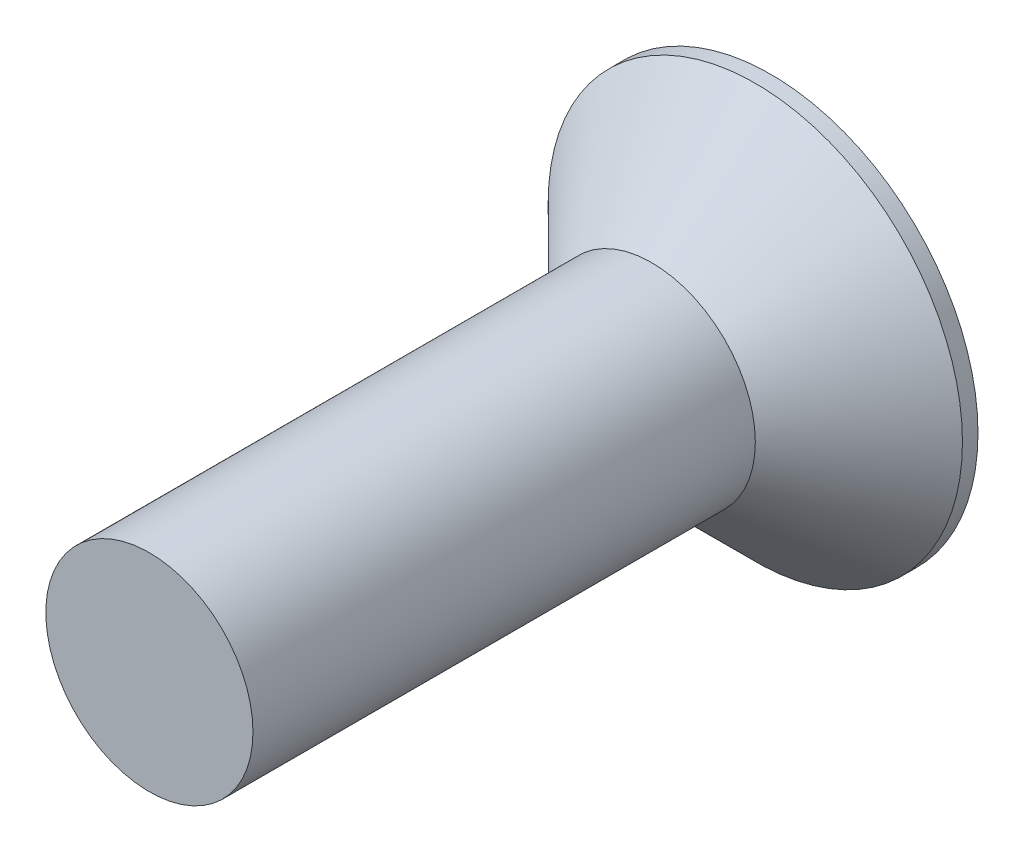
ISO-10303-21;
HEADER;
FILE_DESCRIPTION(('STEP AP214'),'2;1');
FILE_NAME('part.step','',(''),(''),'','','');
FILE_SCHEMA(('AUTOMOTIVE_DESIGN { 1 0 10303 214 1 1 1 1 }'));
ENDSEC;
DATA;
#1=APPLICATION_CONTEXT('core data for automotive mechanical design processes');
#2=APPLICATION_PROTOCOL_DEFINITION('international standard','automotive_design',2000,#1);
#3=PRODUCT_CONTEXT('',#1,'mechanical');
#4=PRODUCT('Part','Part','',(#3));
#5=PRODUCT_RELATED_PRODUCT_CATEGORY('part','',(#4));
#6=PRODUCT_DEFINITION_FORMATION('','',#4);
#7=PRODUCT_DEFINITION_CONTEXT('part definition',#1,'design');
#8=PRODUCT_DEFINITION('design','',#6,#7);
#9=PRODUCT_DEFINITION_SHAPE('','',#8);
#10=(LENGTH_UNIT() NAMED_UNIT(*) SI_UNIT(.MILLI.,.METRE.));
#11=(NAMED_UNIT(*) PLANE_ANGLE_UNIT() SI_UNIT($,.RADIAN.));
#12=(NAMED_UNIT(*) SI_UNIT($,.STERADIAN.) SOLID_ANGLE_UNIT());
#13=UNCERTAINTY_MEASURE_WITH_UNIT(LENGTH_MEASURE(1.E-05),#10,'distance_accuracy_value','');
#14=(GEOMETRIC_REPRESENTATION_CONTEXT(3) GLOBAL_UNCERTAINTY_ASSIGNED_CONTEXT((#13)) GLOBAL_UNIT_ASSIGNED_CONTEXT((#10,
#11,#12)) REPRESENTATION_CONTEXT('',''));
#15=CARTESIAN_POINT('',(0.,0.,0.));
#16=DIRECTION('',(0.,0.,1.));
#17=DIRECTION('',(1.,0.,0.));
#18=AXIS2_PLACEMENT_3D('',#15,#16,#17);
#19=CARTESIAN_POINT('',(0.,0.,12.));
#20=DIRECTION('',(0.,0.,1.));
#21=DIRECTION('',(1.,0.,0.));
#22=AXIS2_PLACEMENT_3D('',#19,#20,#21);
#23=PLANE('',#22);
#24=CARTESIAN_POINT('',(0.,0.,12.));
#25=DIRECTION('',(0.,0.,1.));
#26=DIRECTION('',(1.,0.,0.));
#27=AXIS2_PLACEMENT_3D('',#24,#25,#26);
#28=CIRCLE('',#27,2.);
#29=CARTESIAN_POINT('',(2.,0.,12.));
#30=VERTEX_POINT('',#29);
#31=EDGE_CURVE('E11',#30,#30,#28,.T.);
#32=ORIENTED_EDGE('',*,*,#31,.T.);
#33=EDGE_LOOP('',(#32));
#34=FACE_BOUND('',#33,.T.);
#35=ADVANCED_FACE('F32',(#34),#23,.T.);
#36=CARTESIAN_POINT('',(0.,0.,12.));
#37=DIRECTION('',(0.,0.,1.));
#38=DIRECTION('',(1.,0.,0.));
#39=AXIS2_PLACEMENT_3D('',#36,#37,#38);
#40=CYLINDRICAL_SURFACE('',#39,2.);
#41=CARTESIAN_POINT('',(0.,0.,2.3));
#42=DIRECTION('',(0.,0.,1.));
#43=DIRECTION('',(1.,0.,0.));
#44=AXIS2_PLACEMENT_3D('',#41,#42,#43);
#45=CIRCLE('',#44,2.);
#46=CARTESIAN_POINT('',(2.,0.,2.3));
#47=VERTEX_POINT('',#46);
#48=EDGE_CURVE('E39',#47,#47,#45,.T.);
#49=ORIENTED_EDGE('',*,*,#48,.T.);
#50=EDGE_LOOP('',(#49));
#51=FACE_BOUND('',#50,.T.);
#52=ORIENTED_EDGE('',*,*,#31,.F.);
#53=EDGE_LOOP('',(#52));
#54=FACE_BOUND('',#53,.T.);
#55=ADVANCED_FACE('F146',(#51,#54),#40,.T.);
#56=CARTESIAN_POINT('',(0.,0.,2.3));
#57=DIRECTION('',(0.,0.,-1.));
#58=DIRECTION('',(-1.,0.,0.));
#59=AXIS2_PLACEMENT_3D('',#56,#57,#58);
#60=CONICAL_SURFACE('',#59,2.,0.78539816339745);
#61=CARTESIAN_POINT('',(0.,0.,0.300000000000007));
#62=DIRECTION('',(0.,0.,1.));
#63=DIRECTION('',(1.,0.,0.));
#64=AXIS2_PLACEMENT_3D('',#61,#62,#63);
#65=CIRCLE('',#64,4.);
#66=CARTESIAN_POINT('',(4.,0.,0.300000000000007));
#67=VERTEX_POINT('',#66);
#68=EDGE_CURVE('E141',#67,#67,#65,.T.);
#69=ORIENTED_EDGE('',*,*,#68,.T.);
#70=EDGE_LOOP('',(#69));
#71=FACE_BOUND('',#70,.T.);
#72=ORIENTED_EDGE('',*,*,#48,.F.);
#73=EDGE_LOOP('',(#72));
#74=FACE_BOUND('',#73,.T.);
#75=ADVANCED_FACE('F149',(#71,#74),#60,.T.);
#76=CARTESIAN_POINT('',(0.,0.,12.));
#77=DIRECTION('',(0.,0.,1.));
#78=DIRECTION('',(1.,0.,0.));
#79=AXIS2_PLACEMENT_3D('',#76,#77,#78);
#80=CYLINDRICAL_SURFACE('',#79,4.);
#81=CARTESIAN_POINT('',(0.,0.,0.));
#82=DIRECTION('',(0.,0.,1.));
#83=DIRECTION('',(1.,0.,0.));
#84=AXIS2_PLACEMENT_3D('',#81,#82,#83);
#85=CIRCLE('',#84,4.);
#86=CARTESIAN_POINT('',(4.,0.,0.));
#87=VERTEX_POINT('',#86);
#88=EDGE_CURVE('E133',#87,#87,#85,.T.);
#89=ORIENTED_EDGE('',*,*,#88,.T.);
#90=EDGE_LOOP('',(#89));
#91=FACE_BOUND('',#90,.T.);
#92=ORIENTED_EDGE('',*,*,#68,.F.);
#93=EDGE_LOOP('',(#92));
#94=FACE_BOUND('',#93,.T.);
#95=ADVANCED_FACE('F151',(#91,#94),#80,.T.);
#96=CARTESIAN_POINT('',(0.,-4.,0.));
#97=DIRECTION('',(0.,0.,-1.));
#98=DIRECTION('',(-1.,0.,0.));
#99=AXIS2_PLACEMENT_3D('',#96,#97,#98);
#100=PLANE('',#99);
#101=DIRECTION('',(0.866025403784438,-0.5,0.));
#102=VECTOR('',#101,1.);
#103=CARTESIAN_POINT('',(0.,1.44337567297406,0.));
#104=LINE('',#103,#102);
#105=CARTESIAN_POINT('',(0.,1.44337567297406,0.));
#106=VERTEX_POINT('',#105);
#107=CARTESIAN_POINT('',(1.25,0.721687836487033,0.));
#108=VERTEX_POINT('',#107);
#109=EDGE_CURVE('E46',#106,#108,#104,.T.);
#110=ORIENTED_EDGE('',*,*,#109,.F.);
#111=DIRECTION('',(0.866025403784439,0.5,0.));
#112=VECTOR('',#111,1.);
#113=CARTESIAN_POINT('',(-1.25,0.721687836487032,0.));
#114=LINE('',#113,#112);
#115=CARTESIAN_POINT('',(-1.25,0.721687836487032,0.));
#116=VERTEX_POINT('',#115);
#117=EDGE_CURVE('E129',#116,#106,#114,.T.);
#118=ORIENTED_EDGE('',*,*,#117,.F.);
#119=DIRECTION('',(0.,1.,0.));
#120=VECTOR('',#119,1.);
#121=CARTESIAN_POINT('',(-1.25,-0.721687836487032,0.));
#122=LINE('',#121,#120);
#123=CARTESIAN_POINT('',(-1.25,-0.721687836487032,0.));
#124=VERTEX_POINT('',#123);
#125=EDGE_CURVE('E127',#124,#116,#122,.T.);
#126=ORIENTED_EDGE('',*,*,#125,.F.);
#127=DIRECTION('',(-0.866025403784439,0.5,0.));
#128=VECTOR('',#127,1.);
#129=CARTESIAN_POINT('',(0.,-1.44337567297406,0.));
#130=LINE('',#129,#128);
#131=CARTESIAN_POINT('',(0.,-1.44337567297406,0.));
#132=VERTEX_POINT('',#131);
#133=EDGE_CURVE('E94',#132,#124,#130,.T.);
#134=ORIENTED_EDGE('',*,*,#133,.F.);
#135=DIRECTION('',(-0.866025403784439,-0.5,0.));
#136=VECTOR('',#135,1.);
#137=CARTESIAN_POINT('',(1.25,-0.721687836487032,0.));
#138=LINE('',#137,#136);
#139=CARTESIAN_POINT('',(1.25,-0.721687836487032,0.));
#140=VERTEX_POINT('',#139);
#141=EDGE_CURVE('E123',#140,#132,#138,.T.);
#142=ORIENTED_EDGE('',*,*,#141,.F.);
#143=DIRECTION('',(0.,-1.,0.));
#144=VECTOR('',#143,1.);
#145=CARTESIAN_POINT('',(1.25,0.721687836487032,0.));
#146=LINE('',#145,#144);
#147=EDGE_CURVE('E120',#108,#140,#146,.T.);
#148=ORIENTED_EDGE('',*,*,#147,.F.);
#149=EDGE_LOOP('',(#110,#118,#126,#134,#142,#148));
#150=FACE_BOUND('',#149,.T.);
#151=ORIENTED_EDGE('',*,*,#88,.F.);
#152=EDGE_LOOP('',(#151));
#153=FACE_BOUND('',#152,.T.);
#154=ADVANCED_FACE('F158',(#150,#153),#100,.T.);
#155=CARTESIAN_POINT('',(0.,1.44337567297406,2.));
#156=DIRECTION('',(0.5,0.866025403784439,0.));
#157=DIRECTION('',(-0.866025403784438,0.5,0.));
#158=AXIS2_PLACEMENT_3D('',#155,#156,#157);
#159=PLANE('',#158);
#160=ORIENTED_EDGE('',*,*,#109,.T.);
#161=DIRECTION('',(0.,0.,-1.));
#162=VECTOR('',#161,1.);
#163=CARTESIAN_POINT('',(1.25,0.721687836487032,2.));
#164=LINE('',#163,#162);
#165=CARTESIAN_POINT('',(1.25,0.721687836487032,2.));
#166=VERTEX_POINT('',#165);
#167=EDGE_CURVE('E76',#166,#108,#164,.T.);
#168=ORIENTED_EDGE('',*,*,#167,.F.);
#169=DIRECTION('',(0.866025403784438,-0.5,0.));
#170=VECTOR('',#169,1.);
#171=CARTESIAN_POINT('',(0.,1.44337567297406,2.));
#172=LINE('',#171,#170);
#173=CARTESIAN_POINT('',(0.,1.44337567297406,2.));
#174=VERTEX_POINT('',#173);
#175=EDGE_CURVE('E131',#174,#166,#172,.T.);
#176=ORIENTED_EDGE('',*,*,#175,.F.);
#177=DIRECTION('',(0.,0.,-1.));
#178=VECTOR('',#177,1.);
#179=CARTESIAN_POINT('',(0.,1.44337567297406,2.));
#180=LINE('',#179,#178);
#181=EDGE_CURVE('E54',#174,#106,#180,.T.);
#182=ORIENTED_EDGE('',*,*,#181,.T.);
#183=EDGE_LOOP('',(#160,#168,#176,#182));
#184=FACE_BOUND('',#183,.T.);
#185=ADVANCED_FACE('F189',(#184),#159,.F.);
#186=CARTESIAN_POINT('',(-1.25,0.721687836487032,2.));
#187=DIRECTION('',(-0.5,0.866025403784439,0.));
#188=DIRECTION('',(-0.866025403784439,-0.5,0.));
#189=AXIS2_PLACEMENT_3D('',#186,#187,#188);
#190=PLANE('',#189);
#191=ORIENTED_EDGE('',*,*,#117,.T.);
#192=ORIENTED_EDGE('',*,*,#181,.F.);
#193=DIRECTION('',(0.866025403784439,0.5,0.));
#194=VECTOR('',#193,1.);
#195=CARTESIAN_POINT('',(-1.25,0.721687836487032,2.));
#196=LINE('',#195,#194);
#197=CARTESIAN_POINT('',(-1.25,0.721687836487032,2.));
#198=VERTEX_POINT('',#197);
#199=EDGE_CURVE('E106',#198,#174,#196,.T.);
#200=ORIENTED_EDGE('',*,*,#199,.F.);
#201=DIRECTION('',(0.,0.,-1.));
#202=VECTOR('',#201,1.);
#203=CARTESIAN_POINT('',(-1.25,0.721687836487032,2.));
#204=LINE('',#203,#202);
#205=EDGE_CURVE('E98',#198,#116,#204,.T.);
#206=ORIENTED_EDGE('',*,*,#205,.T.);
#207=EDGE_LOOP('',(#191,#192,#200,#206));
#208=FACE_BOUND('',#207,.T.);
#209=ADVANCED_FACE('F199',(#208),#190,.F.);
#210=CARTESIAN_POINT('',(-1.25,-0.721687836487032,2.));
#211=DIRECTION('',(-1.,0.,0.));
#212=DIRECTION('',(0.,-1.,0.));
#213=AXIS2_PLACEMENT_3D('',#210,#211,#212);
#214=PLANE('',#213);
#215=ORIENTED_EDGE('',*,*,#125,.T.);
#216=ORIENTED_EDGE('',*,*,#205,.F.);
#217=DIRECTION('',(0.,1.,0.));
#218=VECTOR('',#217,1.);
#219=CARTESIAN_POINT('',(-1.25,-0.721687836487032,2.));
#220=LINE('',#219,#218);
#221=CARTESIAN_POINT('',(-1.25,-0.721687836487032,2.));
#222=VERTEX_POINT('',#221);
#223=EDGE_CURVE('E102',#222,#198,#220,.T.);
#224=ORIENTED_EDGE('',*,*,#223,.F.);
#225=DIRECTION('',(0.,0.,-1.));
#226=VECTOR('',#225,1.);
#227=CARTESIAN_POINT('',(-1.25,-0.721687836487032,2.));
#228=LINE('',#227,#226);
#229=EDGE_CURVE('E87',#222,#124,#228,.T.);
#230=ORIENTED_EDGE('',*,*,#229,.T.);
#231=EDGE_LOOP('',(#215,#216,#224,#230));
#232=FACE_BOUND('',#231,.T.);
#233=ADVANCED_FACE('F103',(#232),#214,.F.);
#234=CARTESIAN_POINT('',(0.,-1.44337567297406,2.));
#235=DIRECTION('',(-0.5,-0.866025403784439,0.));
#236=DIRECTION('',(0.866025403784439,-0.5,0.));
#237=AXIS2_PLACEMENT_3D('',#234,#235,#236);
#238=PLANE('',#237);
#239=ORIENTED_EDGE('',*,*,#133,.T.);
#240=ORIENTED_EDGE('',*,*,#229,.F.);
#241=DIRECTION('',(-0.866025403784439,0.5,0.));
#242=VECTOR('',#241,1.);
#243=CARTESIAN_POINT('',(0.,-1.44337567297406,2.));
#244=LINE('',#243,#242);
#245=CARTESIAN_POINT('',(0.,-1.44337567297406,2.));
#246=VERTEX_POINT('',#245);
#247=EDGE_CURVE('E91',#246,#222,#244,.T.);
#248=ORIENTED_EDGE('',*,*,#247,.F.);
#249=DIRECTION('',(0.,0.,-1.));
#250=VECTOR('',#249,1.);
#251=CARTESIAN_POINT('',(0.,-1.44337567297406,2.));
#252=LINE('',#251,#250);
#253=EDGE_CURVE('E99',#246,#132,#252,.T.);
#254=ORIENTED_EDGE('',*,*,#253,.T.);
#255=EDGE_LOOP('',(#239,#240,#248,#254));
#256=FACE_BOUND('',#255,.T.);
#257=ADVANCED_FACE('F89',(#256),#238,.F.);
#258=CARTESIAN_POINT('',(1.25,-0.721687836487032,2.));
#259=DIRECTION('',(0.5,-0.866025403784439,0.));
#260=DIRECTION('',(0.866025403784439,0.5,0.));
#261=AXIS2_PLACEMENT_3D('',#258,#259,#260);
#262=PLANE('',#261);
#263=ORIENTED_EDGE('',*,*,#141,.T.);
#264=ORIENTED_EDGE('',*,*,#253,.F.);
#265=DIRECTION('',(-0.866025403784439,-0.5,0.));
#266=VECTOR('',#265,1.);
#267=CARTESIAN_POINT('',(1.25,-0.721687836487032,2.));
#268=LINE('',#267,#266);
#269=CARTESIAN_POINT('',(1.25,-0.721687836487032,2.));
#270=VERTEX_POINT('',#269);
#271=EDGE_CURVE('E112',#270,#246,#268,.T.);
#272=ORIENTED_EDGE('',*,*,#271,.F.);
#273=DIRECTION('',(0.,0.,-1.));
#274=VECTOR('',#273,1.);
#275=CARTESIAN_POINT('',(1.25,-0.721687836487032,2.));
#276=LINE('',#275,#274);
#277=EDGE_CURVE('E136',#270,#140,#276,.T.);
#278=ORIENTED_EDGE('',*,*,#277,.T.);
#279=EDGE_LOOP('',(#263,#264,#272,#278));
#280=FACE_BOUND('',#279,.T.);
#281=ADVANCED_FACE('F224',(#280),#262,.F.);
#282=CARTESIAN_POINT('',(1.25,0.721687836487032,2.));
#283=DIRECTION('',(1.,0.,0.));
#284=DIRECTION('',(0.,0.,-1.));
#285=AXIS2_PLACEMENT_3D('',#282,#283,#284);
#286=PLANE('',#285);
#287=ORIENTED_EDGE('',*,*,#147,.T.);
#288=ORIENTED_EDGE('',*,*,#277,.F.);
#289=DIRECTION('',(0.,-1.,0.));
#290=VECTOR('',#289,1.);
#291=CARTESIAN_POINT('',(1.25,0.721687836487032,2.));
#292=LINE('',#291,#290);
#293=EDGE_CURVE('E114',#166,#270,#292,.T.);
#294=ORIENTED_EDGE('',*,*,#293,.F.);
#295=ORIENTED_EDGE('',*,*,#167,.T.);
#296=EDGE_LOOP('',(#287,#288,#294,#295));
#297=FACE_BOUND('',#296,.T.);
#298=ADVANCED_FACE('F233',(#297),#286,.F.);
#299=CARTESIAN_POINT('',(2.5,0.,2.));
#300=DIRECTION('',(0.,0.,-1.));
#301=DIRECTION('',(-1.,0.,0.));
#302=AXIS2_PLACEMENT_3D('',#299,#300,#301);
#303=PLANE('',#302);
#304=ORIENTED_EDGE('',*,*,#175,.T.);
#305=ORIENTED_EDGE('',*,*,#293,.T.);
#306=ORIENTED_EDGE('',*,*,#271,.T.);
#307=ORIENTED_EDGE('',*,*,#247,.T.);
#308=ORIENTED_EDGE('',*,*,#223,.T.);
#309=ORIENTED_EDGE('',*,*,#199,.T.);
#310=EDGE_LOOP('',(#304,#305,#306,#307,#308,#309));
#311=FACE_BOUND('',#310,.T.);
#312=ADVANCED_FACE('F109',(#311),#303,.T.);
#313=CLOSED_SHELL('',(#35,#55,#75,#95,#154,#185,#209,#233,#257,#281,#298,#312));
#314=MANIFOLD_SOLID_BREP('B2',#313);
#315=ADVANCED_BREP_SHAPE_REPRESENTATION('',(#18,#314),#14);
#316=SHAPE_DEFINITION_REPRESENTATION(#9,#315);
ENDSEC;
END-ISO-10303-21;
